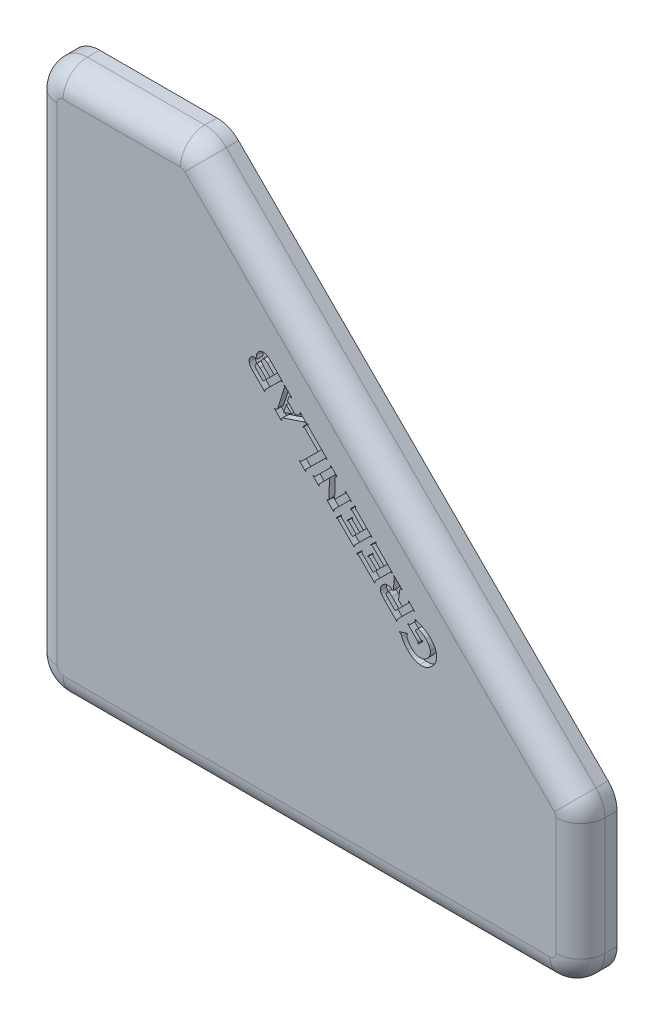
from build123d import *

# Parameters (mm, degrees)
BOSS_EXTRUDE1_DEPTH = 3
FILLET1_R           = 2.500013
FILLET2_R           = 2
CUT_EXTRUDE1_DEPTH  = 0.5


with BuildPart() as part:
    # Sketch1 → Boss-Extrude1 (new body)
    with BuildSketch(Plane.XY.offset(3)):
        Polygon((-9.32015067, 22.500001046), (-22.500150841, 22.500001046), (-22.500150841, -22.499998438), (22.49984816, -22.499998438), (22.49984816, -9.319997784), align=None)
    extrude(amount=-BOSS_EXTRUDE1_DEPTH)

    # Fillet1
    fillet1_edges = [part.edges().sort_by_distance(p)[0] for p in [
        (22.49984816, -9.319997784, 1.5),
        (22.49984816, -22.499998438, 1.5),
        (-22.500150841, -22.499998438, 1.5),
        (-22.500150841, 22.500001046, 1.5),
        (-9.32015067, 22.500001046, 1.5),
    ]]
    fillet(fillet1_edges, radius=FILLET1_R)

    # Fillet2
    fillet2_edges = [part.edges().sort_by_distance(p)[0] for p in [
        (22.49984816, -15.177761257, 3),
        (6.589848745, 6.590001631, 3),
        (-15.177913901, 22.500001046, 3),
        (-22.500150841, 1.304e-06, 3),
        (-0.000151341, -22.499998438, 3),
        (-21.767913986, -21.767761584, 3),
        (-21.767913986, 21.767764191, 3),
        (-9.398976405, 22.309698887, 3),
        (21.767611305, -21.767761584, 3),
        (22.309546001, -9.398823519, 3),
    ]]
    fillet(fillet2_edges, radius=FILLET2_R)

    # Sketch2 → Cut-Extrude1 (cut)
    # profile 1 of 8: a face of its own
    with BuildSketch(Plane.XY.offset(3)):
        with BuildLine():
            add(Edge.make_bspline(
                [(-4.052609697, 9.988719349), (-4.061625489, 10.01338589), (-4.078703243, 10.060109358), (-4.097706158, 10.127687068), (-4.110036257, 10.188300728), (-4.112313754, 10.226484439), (-4.113373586, 10.244253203)],
                knots=[0, 0, 0, 0, 1.194118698, 2.26190481, 3.191178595, 4, 4, 4, 4], degree=3))
            add(Edge.make_bspline(
                [(-4.113373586, 10.244253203), (-4.112251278, 10.258581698), (-4.109986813, 10.28749211), (-4.100600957, 10.330299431), (-4.086086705, 10.372462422), (-4.067784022, 10.414142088), (-4.044759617, 10.455238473), (-4.016805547, 10.495261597), (-3.984816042, 10.535245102), (-3.960423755, 10.560211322), (-3.947900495, 10.573029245)],
                knots=[0, 0, 0, 0, 0.914813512, 1.845806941, 2.782131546, 3.751881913, 4.742218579, 5.777635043, 6.859014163, 8, 8, 8, 8], degree=3))
            add(Edge.make_bspline(
                [(-3.947900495, 10.573029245), (-3.930540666, 10.589548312), (-3.896655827, 10.621792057), (-3.840894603, 10.661961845), (-3.783413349, 10.694431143), (-3.723930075, 10.719180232), (-3.662236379, 10.735580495), (-3.59877923, 10.743481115), (-3.533494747, 10.744490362), (-3.489956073, 10.738368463), (-3.467757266, 10.735247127)],
                knots=[0, 0, 0, 0, 1.087950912, 2.12358309, 3.113398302, 4.082526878, 5.043361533, 6.004617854, 6.982626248, 8, 8, 8, 8], degree=3))
            add(Edge.make_bspline(
                [(-3.467757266, 10.735247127), (-3.44756126, 10.731382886), (-3.406557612, 10.723537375), (-3.346351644, 10.702602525), (-3.285673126, 10.676524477), (-3.224907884, 10.643791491), (-3.164011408, 10.604547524), (-3.103409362, 10.558680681), (-3.042071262, 10.506996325), (-3.002917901, 10.468590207), (-2.982731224, 10.448788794)],
                knots=[0, 0, 0, 0, 0.861251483, 1.748585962, 2.665721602, 3.629309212, 4.639063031, 5.700792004, 6.814575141, 8, 8, 8, 8], degree=3))
            Line((-2.982731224, 10.448788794), (-1.972531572, 9.431536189))
            Line((-1.972531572, 9.431536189), (-2.007253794, 9.396813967))
            add(Edge.make_bspline(
                [(-2.007253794, 9.396813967), (-2.0152966, 9.400824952), (-2.030305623, 9.408310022), (-2.053099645, 9.415797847), (-2.074463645, 9.418577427), (-2.094685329, 9.417491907), (-2.114490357, 9.412658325), (-2.133541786, 9.401945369), (-2.153836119, 9.388741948), (-2.166214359, 9.376967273), (-2.172726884, 9.3707723)],
                knots=[0, 0, 0, 0, 1.176144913, 2.194853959, 3.126109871, 3.980066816, 4.835992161, 5.768151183, 6.825764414, 8, 8, 8, 8], degree=3))
            Line((-2.172726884, 9.3707723), (-3.368473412, 8.183163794))
            add(Edge.make_bspline(
                [(-3.368473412, 8.183163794), (-3.374524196, 8.176556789), (-3.385896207, 8.164139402), (-3.400771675, 8.145270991), (-3.4098727, 8.125863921), (-3.415980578, 8.106893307), (-3.416745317, 8.086862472), (-3.41397225, 8.065374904), (-3.406433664, 8.042061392), (-3.399708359, 8.026134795), (-3.396142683, 8.017690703)],
                knots=[0, 0, 0, 0, 1.175108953, 2.208532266, 3.130785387, 3.970790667, 4.801718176, 5.733666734, 6.798417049, 8, 8, 8, 8], degree=3))
            Line((-3.396142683, 8.017690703), (-3.430864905, 7.983511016))
            Line((-3.430864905, 7.983511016), (-4.431841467, 8.99154053))
            add(Edge.make_bspline(
                [(-4.431841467, 8.99154053), (-4.452916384, 9.01316801), (-4.493518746, 9.054834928), (-4.547940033, 9.119403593), (-4.595509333, 9.182133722), (-4.635084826, 9.243899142), (-4.66755187, 9.304042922), (-4.692997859, 9.362632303), (-4.710161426, 9.420466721), (-4.716001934, 9.458940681), (-4.718842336, 9.477651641)],
                knots=[0, 0, 0, 0, 1.260823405, 2.429068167, 3.524246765, 4.546689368, 5.489478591, 6.37610682, 7.210255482, 8, 8, 8, 8], degree=3))
            add(Edge.make_bspline(
                [(-4.718842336, 9.477651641), (-4.720319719, 9.496804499), (-4.723245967, 9.534740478), (-4.720737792, 9.59129779), (-4.710505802, 9.645973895), (-4.695058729, 9.699232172), (-4.671658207, 9.750234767), (-4.643060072, 9.800144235), (-4.606618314, 9.847440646), (-4.578940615, 9.877004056), (-4.564762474, 9.892148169)],
                knots=[0, 0, 0, 0, 1.004803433, 1.990209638, 2.951832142, 3.910002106, 4.884393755, 5.881052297, 6.91455071, 8, 8, 8, 8], degree=3))
            add(Edge.make_bspline(
                [(-4.564762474, 9.892148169), (-4.54725323, 9.908360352), (-4.513678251, 9.939448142), (-4.458771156, 9.97681107), (-4.403021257, 10.004275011), (-4.344497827, 10.020314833), (-4.28149052, 10.026966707), (-4.211891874, 10.022612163), (-4.134262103, 10.010706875), (-4.080880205, 9.996332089), (-4.052609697, 9.988719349)],
                knots=[0, 0, 0, 0, 1.033588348, 1.981964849, 2.869401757, 3.716124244, 4.599497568, 5.604424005, 6.731327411, 8, 8, 8, 8], degree=3))
        make_face()
        with BuildLine():
            Line((-3.289263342, 8.951935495), (-3.818777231, 9.485247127))
            add(Edge.make_bspline(
                [(-3.818777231, 9.485247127), (-3.838340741, 9.504413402), (-3.874555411, 9.539892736), (-3.929183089, 9.583752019), (-3.978863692, 9.614742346), (-4.024590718, 9.633178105), (-4.068413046, 9.638207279), (-4.110525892, 9.630015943), (-4.151600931, 9.609632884), (-4.174819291, 9.588282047), (-4.187158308, 9.576935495)],
                knots=[0, 0, 0, 0, 1.512587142, 2.80000083, 3.86244346, 4.738380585, 5.501965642, 6.264307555, 7.077594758, 8, 8, 8, 8], degree=3))
            add(Edge.make_bspline(
                [(-4.187158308, 9.576935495), (-4.19821763, 9.564720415), (-4.219125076, 9.541628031), (-4.240315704, 9.501727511), (-4.248251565, 9.460025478), (-4.244143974, 9.416506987), (-4.225462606, 9.370795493), (-4.194379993, 9.321213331), (-4.15117422, 9.26569728), (-4.115759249, 9.228997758), (-4.096555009, 9.209096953)],
                knots=[0, 0, 0, 0, 0.910934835, 1.722105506, 2.466937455, 3.231723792, 4.110167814, 5.175651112, 6.468459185, 8, 8, 8, 8], degree=3))
            Line((-4.096555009, 9.209096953), (-3.56704112, 8.675785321))
            Line((-3.56704112, 8.675785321), (-3.289263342, 8.951935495))
        make_face(mode=Mode.SUBTRACT)
        with BuildLine():
            Line((-2.664263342, 9.572595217), (-3.198660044, 10.110789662))
            add(Edge.make_bspline(
                [(-3.198660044, 10.110789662), (-3.219355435, 10.130852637), (-3.258092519, 10.168405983), (-3.319509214, 10.213423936), (-3.377734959, 10.245967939), (-3.434019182, 10.265190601), (-3.488380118, 10.26931312), (-3.540169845, 10.259780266), (-3.589422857, 10.236385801), (-3.616804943, 10.211589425), (-3.631060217, 10.198680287)],
                knots=[0, 0, 0, 0, 1.382833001, 2.588350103, 3.645353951, 4.576401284, 5.421008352, 6.233527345, 7.080363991, 8, 8, 8, 8], degree=3))
            add(Edge.make_bspline(
                [(-3.631060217, 10.198680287), (-3.644184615, 10.184447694), (-3.669211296, 10.157307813), (-3.692603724, 10.108130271), (-3.703004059, 10.056593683), (-3.698401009, 10.002108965), (-3.680229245, 9.94551833), (-3.647874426, 9.886906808), (-3.60313547, 9.825385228), (-3.565757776, 9.786444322), (-3.545882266, 9.765737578)],
                knots=[0, 0, 0, 0, 0.924924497, 1.763722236, 2.577660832, 3.422057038, 4.358524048, 5.41115404, 6.623386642, 8, 8, 8, 8], degree=3))
            Line((-3.545882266, 9.765737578), (-3.011485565, 9.227543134))
            Line((-3.011485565, 9.227543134), (-2.664263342, 9.572595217))
        make_face(mode=Mode.SUBTRACT)
    # profile 2 of 8: a face of its own
    with BuildSketch(Plane.XY.offset(3)):
        with BuildLine():
            Line((-1.567470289, 8.259890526), (-0.928364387, 7.616444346))
            Line((-0.928364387, 7.616444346), (-0.67717081, 7.699994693))
            add(Edge.make_bspline(
                [(-0.67717081, 7.699994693), (-0.663509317, 7.705195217), (-0.637972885, 7.714916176), (-0.603916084, 7.73169948), (-0.576095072, 7.748178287), (-0.561289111, 7.760929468), (-0.554557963, 7.766726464)],
                knots=[0, 0, 0, 0, 1.248191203, 2.333152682, 3.24221082, 4, 4, 4, 4], degree=3))
            add(Edge.make_bspline(
                [(-0.554557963, 7.766726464), (-0.549425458, 7.772138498), (-0.539538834, 7.782563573), (-0.529110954, 7.801030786), (-0.522439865, 7.820332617), (-0.519595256, 7.84081363), (-0.521429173, 7.862400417), (-0.527653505, 7.884657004), (-0.537753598, 7.907876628), (-0.546610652, 7.923067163), (-0.551302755, 7.931114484)],
                knots=[0, 0, 0, 0, 0.989809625, 1.906647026, 2.797508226, 3.696466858, 4.638256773, 5.660338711, 6.760543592, 8, 8, 8, 8], degree=3))
            Line((-0.551302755, 7.931114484), (-0.516580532, 7.965836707))
            Line((-0.516580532, 7.965836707), (0.000455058, 7.445003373))
            Line((0.000455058, 7.445003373), (-0.034267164, 7.410281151))
            add(Edge.make_bspline(
                [(-0.034267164, 7.410281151), (-0.043319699, 7.416882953), (-0.060422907, 7.429355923), (-0.087394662, 7.442974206), (-0.112868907, 7.45217856), (-0.138535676, 7.455593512), (-0.166487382, 7.453969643), (-0.199324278, 7.448258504), (-0.238604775, 7.438242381), (-0.266523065, 7.4292588), (-0.281662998, 7.424387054)],
                knots=[0, 0, 0, 0, 1.024670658, 1.935938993, 2.758409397, 3.494049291, 4.28989654, 5.313897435, 6.543341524, 8, 8, 8, 8], degree=3))
            Line((-0.281662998, 7.424387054), (-1.892448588, 6.88510754))
            add(Edge.make_bspline(
                [(-1.892448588, 6.88510754), (-1.906873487, 6.880005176), (-1.934276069, 6.870312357), (-1.971285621, 6.85147035), (-2.00331798, 6.831959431), (-2.020868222, 6.816106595), (-2.029167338, 6.808610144)],
                knots=[0, 0, 0, 0, 1.161394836, 2.206269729, 3.151785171, 4, 4, 4, 4], degree=3))
            add(Edge.make_bspline(
                [(-2.029167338, 6.808610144), (-2.036897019, 6.799112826), (-2.052479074, 6.779967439), (-2.060582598, 6.741053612), (-2.056598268, 6.697493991), (-2.045859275, 6.668260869), (-2.040018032, 6.652360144)],
                knots=[0, 0, 0, 0, 0.873026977, 1.759911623, 2.781552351, 4, 4, 4, 4], degree=3))
            Line((-2.040018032, 6.652360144), (-2.074740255, 6.618180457))
            Line((-2.074740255, 6.618180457), (-2.635178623, 7.182416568))
            Line((-2.635178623, 7.182416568), (-2.6004564, 7.216596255))
            add(Edge.make_bspline(
                [(-2.6004564, 7.216596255), (-2.584943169, 7.21064347), (-2.556003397, 7.19953861), (-2.511827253, 7.19696178), (-2.47154136, 7.207216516), (-2.451298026, 7.224194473), (-2.440951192, 7.232872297)],
                knots=[0, 0, 0, 0, 1.160871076, 2.16559288, 3.062392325, 4, 4, 4, 4], degree=3))
            add(Edge.make_bspline(
                [(-2.440951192, 7.232872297), (-2.433584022, 7.240959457), (-2.417941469, 7.258130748), (-2.399743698, 7.290564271), (-2.381297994, 7.32793177), (-2.372057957, 7.355880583), (-2.36716647, 7.370676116)],
                knots=[0, 0, 0, 0, 0.830196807, 1.762738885, 2.815639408, 4, 4, 4, 4], degree=3))
            Line((-2.36716647, 7.370676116), (-1.85935397, 8.956505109))
            add(Edge.make_bspline(
                [(-1.85935397, 8.956505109), (-1.853386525, 8.976347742), (-1.842428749, 9.012783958), (-1.830026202, 9.062955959), (-1.821760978, 9.103229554), (-1.818787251, 9.135746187), (-1.821874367, 9.164187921), (-1.829738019, 9.19218602), (-1.842880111, 9.221624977), (-1.855099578, 9.240588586), (-1.861524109, 9.250558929)],
                knots=[0, 0, 0, 0, 1.614743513, 2.965087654, 4.026632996, 4.817973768, 5.498202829, 6.243649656, 7.076577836, 8, 8, 8, 8], degree=3))
            Line((-1.861524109, 9.250558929), (-1.826801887, 9.285281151))
            Line((-1.826801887, 9.285281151), (-1.223503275, 8.677642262))
            Line((-1.223503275, 8.677642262), (-1.258225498, 8.64292004))
            add(Edge.make_bspline(
                [(-1.258225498, 8.64292004), (-1.266054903, 8.64803172), (-1.280875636, 8.657707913), (-1.303990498, 8.668007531), (-1.325963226, 8.675020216), (-1.347385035, 8.677294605), (-1.368105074, 8.675084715), (-1.38790487, 8.668442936), (-1.406603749, 8.657344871), (-1.417530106, 8.647464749), (-1.423156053, 8.642377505)],
                knots=[0, 0, 0, 0, 1.232196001, 2.332494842, 3.329286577, 4.265054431, 5.153347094, 6.059105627, 7.000639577, 8, 8, 8, 8], degree=3))
            add(Edge.make_bspline(
                [(-1.423156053, 8.642377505), (-1.43032633, 8.634459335), (-1.445743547, 8.617434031), (-1.463838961, 8.585235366), (-1.482290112, 8.547623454), (-1.491846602, 8.519542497), (-1.496940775, 8.504573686)],
                knots=[0, 0, 0, 0, 0.811155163, 1.744110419, 2.797477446, 4, 4, 4, 4], degree=3))
            Line((-1.496940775, 8.504573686), (-1.567470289, 8.259890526))
        make_face()
        Polygon((-1.670551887, 7.947390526), (-1.894618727, 7.2860407), (-1.238694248, 7.512277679), align=None, mode=Mode.SUBTRACT)
    # profile 3 of 8: a face of its own
    with BuildSketch(Plane.XY.offset(3)):
        with BuildLine():
            Line((0.961669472, 5.922116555), (-0.116889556, 7.008271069))
            add(Edge.make_bspline(
                [(-0.116889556, 7.008271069), (-0.123229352, 7.014441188), (-0.13525892, 7.026148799), (-0.154822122, 7.039578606), (-0.173631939, 7.049419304), (-0.192544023, 7.054649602), (-0.212271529, 7.054712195), (-0.233530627, 7.052375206), (-0.256363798, 7.043933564), (-0.271926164, 7.036941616), (-0.280192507, 7.033227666)],
                knots=[0, 0, 0, 0, 1.17108417, 2.222095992, 3.133640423, 3.977031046, 4.792693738, 5.73555689, 6.797183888, 8, 8, 8, 8], degree=3))
            Line((-0.280192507, 7.033227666), (-0.314372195, 7.067949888))
            Line((-0.314372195, 7.067949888), (0.102294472, 7.481903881))
            Line((0.102294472, 7.481903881), (0.13647416, 7.447181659))
            add(Edge.make_bspline(
                [(0.13647416, 7.447181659), (0.132735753, 7.438919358), (0.125697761, 7.423364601), (0.117610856, 7.400626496), (0.1142739, 7.379508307), (0.114413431, 7.359841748), (0.119983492, 7.341180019), (0.128720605, 7.322253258), (0.142721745, 7.303481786), (0.15389872, 7.291364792), (0.159803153, 7.284963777)],
                knots=[0, 0, 0, 0, 1.212772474, 2.283187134, 3.213341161, 4.059923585, 4.886945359, 5.795479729, 6.835423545, 8, 8, 8, 8], degree=3))
            Line((0.159803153, 7.284963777), (1.68758093, 5.746335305))
            Line((1.68758093, 5.746335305), (1.652858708, 5.711613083))
            add(Edge.make_bspline(
                [(1.652858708, 5.711613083), (1.644637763, 5.71565273), (1.629269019, 5.723204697), (1.606030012, 5.730313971), (1.58480254, 5.7340751), (1.564850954, 5.732830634), (1.545758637, 5.727875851), (1.526932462, 5.717954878), (1.507332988, 5.704397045), (1.495010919, 5.69280777), (1.488470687, 5.686656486)],
                knots=[0, 0, 0, 0, 1.205261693, 2.253190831, 3.19369407, 4.029281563, 4.867584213, 5.773629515, 6.818300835, 8, 8, 8, 8], degree=3))
            Line((1.488470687, 5.686656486), (-0.021945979, 4.186547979))
            add(Edge.make_bspline(
                [(-0.021945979, 4.186547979), (-0.027994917, 4.179940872), (-0.039363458, 4.167523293), (-0.054261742, 4.148656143), (-0.063289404, 4.12924502), (-0.069638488, 4.110295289), (-0.069490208, 4.090403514), (-0.06686539, 4.069149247), (-0.05953503, 4.046013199), (-0.052330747, 4.030397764), (-0.048530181, 4.022159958)],
                knots=[0, 0, 0, 0, 1.180600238, 2.218852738, 3.145415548, 3.989346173, 4.823137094, 5.735826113, 6.805552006, 8, 8, 8, 8], degree=3))
            Line((-0.048530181, 4.022159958), (-0.083252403, 3.98798027))
            Line((-0.083252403, 3.98798027), (-0.600287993, 4.508813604))
            Line((-0.600287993, 4.508813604), (-0.565565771, 4.542993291))
            add(Edge.make_bspline(
                [(-0.565565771, 4.542993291), (-0.557533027, 4.538940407), (-0.54238842, 4.531299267), (-0.519436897, 4.524357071), (-0.498258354, 4.52054949), (-0.478173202, 4.521556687), (-0.458727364, 4.527586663), (-0.439421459, 4.537458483), (-0.419500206, 4.551308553), (-0.40717638, 4.562888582), (-0.400635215, 4.569034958)],
                knots=[0, 0, 0, 0, 1.177978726, 2.220912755, 3.133494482, 3.988782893, 4.829472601, 5.784241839, 6.823933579, 8, 8, 8, 8], degree=3))
            Line((-0.400635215, 4.569034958), (0.961669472, 5.922116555))
        make_face()
    # profile 4 of 8: a face of its own
    with BuildSketch(Plane.XY.offset(3)):
        with BuildLine():
            Line((2.304505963, 3.202598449), (3.133499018, 4.026166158))
            add(Edge.make_bspline(
                [(3.133499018, 4.026166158), (3.145164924, 4.038484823), (3.166350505, 4.060855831), (3.180102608, 4.096439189), (3.18257391, 4.124055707), (3.1794463, 4.145701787), (3.172814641, 4.168862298), (3.165902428, 4.184124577), (3.162253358, 4.192181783)],
                knots=[0, 0, 0, 0, 1.65236534, 3.00073726, 3.641986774, 4.357550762, 5.132924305, 6, 6, 6, 6], degree=3))
            Line((3.162253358, 4.192181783), (3.196975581, 4.226904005))
            Line((3.196975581, 4.226904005), (3.679831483, 3.740792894))
            Line((3.679831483, 3.740792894), (3.645109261, 3.706070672))
            add(Edge.make_bspline(
                [(3.645109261, 3.706070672), (3.637066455, 3.710081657), (3.622057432, 3.717566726), (3.59926341, 3.725054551), (3.57789941, 3.727834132), (3.557677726, 3.726748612), (3.537872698, 3.721915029), (3.518821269, 3.711202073), (3.498526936, 3.697998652), (3.486148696, 3.686223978), (3.479636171, 3.680029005)],
                knots=[0, 0, 0, 0, 1.176144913, 2.194853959, 3.126109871, 3.980066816, 4.835992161, 5.768151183, 6.825764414, 8, 8, 8, 8], degree=3))
            Line((3.479636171, 3.680029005), (2.283889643, 2.492420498))
            add(Edge.make_bspline(
                [(2.283889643, 2.492420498), (2.277838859, 2.485813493), (2.266466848, 2.473396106), (2.25159138, 2.454527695), (2.242490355, 2.435120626), (2.236382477, 2.416150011), (2.235617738, 2.396119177), (2.238390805, 2.374631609), (2.245929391, 2.351318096), (2.252654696, 2.3353915), (2.256220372, 2.326947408)],
                knots=[0, 0, 0, 0, 1.175108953, 2.208532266, 3.130785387, 3.970790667, 4.801718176, 5.733666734, 6.798417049, 8, 8, 8, 8], degree=3))
            Line((2.256220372, 2.326947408), (2.22149815, 2.29276772))
            Line((2.22149815, 2.29276772), (1.658347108, 2.859716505))
            Line((1.658347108, 2.859716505), (1.693069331, 2.893896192))
            add(Edge.make_bspline(
                [(1.693069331, 2.893896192), (1.704031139, 2.887688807), (1.723895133, 2.876440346), (1.754298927, 2.869189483), (1.781827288, 2.871628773), (1.795015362, 2.881788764), (1.801576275, 2.886843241)],
                knots=[0, 0, 0, 0, 1.283938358, 2.326636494, 3.167521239, 4, 4, 4, 4], degree=3))
            add(Edge.make_bspline(
                [(1.801576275, 2.886843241), (1.806406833, 2.892982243), (1.816930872, 2.90635691), (1.826955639, 2.932719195), (1.831699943, 2.965329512), (1.83257053, 2.989004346), (1.833043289, 3.001860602)],
                knots=[0, 0, 0, 0, 0.765805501, 1.668413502, 2.733867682, 4, 4, 4, 4], degree=3))
            Line((1.833043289, 3.001860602), (1.882413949, 4.507936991))
            Line((1.882413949, 4.507936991), (1.076749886, 3.707698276))
            add(Edge.make_bspline(
                [(1.076749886, 3.707698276), (1.070424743, 3.701162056), (1.05868551, 3.689031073), (1.044489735, 3.669371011), (1.034776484, 3.650136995), (1.028776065, 3.630881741), (1.027719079, 3.610796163), (1.031651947, 3.589530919), (1.037814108, 3.565966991), (1.045182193, 3.550440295), (1.049080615, 3.542225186)],
                knots=[0, 0, 0, 0, 1.188388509, 2.205605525, 3.157492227, 3.995643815, 4.824737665, 5.757931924, 6.813731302, 8, 8, 8, 8], degree=3))
            Line((1.049080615, 3.542225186), (1.014358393, 3.508045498))
            Line((1.014358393, 3.508045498), (0.532045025, 3.994156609))
            Line((0.532045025, 3.994156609), (0.566767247, 4.028336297))
            add(Edge.make_bspline(
                [(0.566767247, 4.028336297), (0.575007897, 4.024524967), (0.590471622, 4.017372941), (0.613590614, 4.010137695), (0.634810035, 4.006476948), (0.654875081, 4.007481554), (0.674148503, 4.013476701), (0.693453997, 4.02334264), (0.713375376, 4.037194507), (0.725699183, 4.048774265), (0.732240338, 4.054920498)],
                knots=[0, 0, 0, 0, 1.188132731, 2.229551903, 3.164212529, 3.994609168, 4.834077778, 5.787460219, 6.82564181, 8, 8, 8, 8], degree=3))
            Line((0.732240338, 4.054920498), (1.926901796, 5.241443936))
            add(Edge.make_bspline(
                [(1.926901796, 5.241443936), (1.933008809, 5.247824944), (1.944668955, 5.260008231), (1.959038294, 5.279281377), (1.968315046, 5.298725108), (1.974490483, 5.31789613), (1.975034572, 5.338076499), (1.973026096, 5.359727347), (1.966056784, 5.383185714), (1.959266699, 5.399032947), (1.955656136, 5.407459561)],
                knots=[0, 0, 0, 0, 1.155235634, 2.205696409, 3.12612335, 3.964465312, 4.817365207, 5.74475715, 6.800796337, 8, 8, 8, 8], degree=3))
            Line((1.955656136, 5.407459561), (1.990378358, 5.442181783))
            Line((1.990378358, 5.442181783), (2.5144669, 4.914295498))
            Line((2.5144669, 4.914295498), (2.479744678, 4.879573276))
            add(Edge.make_bspline(
                [(2.479744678, 4.879573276), (2.469154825, 4.886227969), (2.450254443, 4.898105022), (2.420991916, 4.907737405), (2.393741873, 4.905789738), (2.380852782, 4.895500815), (2.374492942, 4.89042397)],
                knots=[0, 0, 0, 0, 1.298366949, 2.317277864, 3.169697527, 4, 4, 4, 4], degree=3))
            add(Edge.make_bspline(
                [(2.374492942, 4.89042397), (2.369035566, 4.883104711), (2.357162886, 4.867181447), (2.352042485, 4.839825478), (2.350328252, 4.811267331), (2.349463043, 4.77919369), (2.348203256, 4.737441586), (2.348013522, 4.706326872), (2.34790874, 4.689143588)],
                knots=[0, 0, 0, 0, 0.786713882, 1.711519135, 2.359256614, 3.289415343, 4.503063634, 6, 6, 6, 6], degree=3))
            Line((2.34790874, 4.689143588), (2.304505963, 3.202598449))
        make_face()
    # profile 5 of 8: a face of its own
    with BuildSketch(Plane.XY.offset(3)):
        with BuildLine():
            Line((4.363967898, 1.871689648), (4.676467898, 2.182019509))
            Line((4.676467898, 2.182019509), (3.770977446, 3.094020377))
            add(Edge.make_bspline(
                [(3.770977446, 3.094020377), (3.764610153, 3.100149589), (3.752635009, 3.111676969), (3.733424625, 3.125650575), (3.714489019, 3.134967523), (3.69552841, 3.140331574), (3.675772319, 3.141241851), (3.65444519, 3.138454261), (3.631138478, 3.130938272), (3.615543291, 3.12352038), (3.60713196, 3.119519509)],
                knots=[0, 0, 0, 0, 1.166996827, 2.194803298, 3.124600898, 3.941970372, 4.779695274, 5.719267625, 6.769877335, 8, 8, 8, 8], degree=3))
            Line((3.60713196, 3.119519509), (3.572409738, 3.154241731))
            Line((3.572409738, 3.154241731), (3.989076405, 3.568195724))
            Line((3.989076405, 3.568195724), (4.023798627, 3.533473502))
            add(Edge.make_bspline(
                [(4.023798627, 3.533473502), (4.019756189, 3.525622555), (4.012147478, 3.510845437), (4.005039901, 3.488271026), (4.00152753, 3.467253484), (4.001897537, 3.439965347), (4.016968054, 3.405103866), (4.037121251, 3.382571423), (4.04821269, 3.37017055)],
                knots=[0, 0, 0, 0, 0.878172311, 1.652903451, 2.345844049, 2.994530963, 4.345921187, 6, 6, 6, 6], degree=3))
            Line((4.04821269, 3.37017055), (5.368199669, 2.040960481))
            Line((5.368199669, 2.040960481), (5.333477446, 2.006238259))
            add(Edge.make_bspline(
                [(5.333477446, 2.006238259), (5.32543464, 2.010249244), (5.310425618, 2.017734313), (5.287631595, 2.025222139), (5.266267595, 2.028001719), (5.246045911, 2.026916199), (5.226240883, 2.022082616), (5.207189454, 2.01136966), (5.186895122, 1.998166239), (5.174516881, 1.986391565), (5.168004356, 1.980196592)],
                knots=[0, 0, 0, 0, 1.176144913, 2.194853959, 3.126109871, 3.980066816, 4.835992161, 5.768151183, 6.825764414, 8, 8, 8, 8], degree=3))
            Line((5.168004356, 1.980196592), (3.972257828, 0.792588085))
            add(Edge.make_bspline(
                [(3.972257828, 0.792588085), (3.966207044, 0.78598108), (3.954835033, 0.773563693), (3.939959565, 0.754695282), (3.93085854, 0.735288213), (3.924750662, 0.716317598), (3.923985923, 0.696286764), (3.92675899, 0.674799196), (3.934297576, 0.651485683), (3.941022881, 0.635559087), (3.944588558, 0.627114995)],
                knots=[0, 0, 0, 0, 1.175108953, 2.208532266, 3.130785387, 3.970790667, 4.801718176, 5.733666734, 6.798417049, 8, 8, 8, 8], degree=3))
            Line((3.944588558, 0.627114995), (3.909866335, 0.592935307))
            Line((3.909866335, 0.592935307), (2.625686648, 1.88579555))
            add(Edge.make_bspline(
                [(2.625686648, 1.88579555), (2.619134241, 1.892098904), (2.606791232, 1.903972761), (2.587288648, 1.918404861), (2.567963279, 1.927947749), (2.548771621, 1.933116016), (2.529036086, 1.934140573), (2.507893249, 1.931246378), (2.485013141, 1.923828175), (2.469542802, 1.916713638), (2.461298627, 1.912922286)],
                knots=[0, 0, 0, 0, 1.195531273, 2.252065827, 3.17781469, 4.014602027, 4.848679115, 5.760566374, 6.806601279, 8, 8, 8, 8], degree=3))
            Line((2.461298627, 1.912922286), (2.426576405, 1.947644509))
            Line((2.426576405, 1.947644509), (2.843243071, 2.361055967))
            Line((2.843243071, 2.361055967), (2.877965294, 2.326333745))
            add(Edge.make_bspline(
                [(2.877965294, 2.326333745), (2.873976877, 2.318097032), (2.866421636, 2.302494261), (2.85865227, 2.279215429), (2.855023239, 2.257736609), (2.856066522, 2.237708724), (2.861748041, 2.218624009), (2.872407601, 2.199948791), (2.885490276, 2.179581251), (2.897596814, 2.167341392), (2.90400696, 2.160860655)],
                knots=[0, 0, 0, 0, 1.192898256, 2.259702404, 3.190558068, 4.0175742, 4.853625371, 5.761171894, 6.814589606, 8, 8, 8, 8], degree=3))
            Line((2.90400696, 2.160860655), (3.77369012, 1.285209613))
            Line((3.77369012, 1.285209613), (4.08619012, 1.595539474))
            Line((4.08619012, 1.595539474), (3.53009203, 2.155435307))
            add(Edge.make_bspline(
                [(3.53009203, 2.155435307), (3.523543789, 2.16174578), (3.511208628, 2.173633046), (3.491458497, 2.188120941), (3.471850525, 2.198106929), (3.452135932, 2.203827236), (3.431865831, 2.205440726), (3.410003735, 2.203066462), (3.38643745, 2.196264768), (3.370347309, 2.189768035), (3.361906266, 2.186359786)],
                knots=[0, 0, 0, 0, 1.173462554, 2.210494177, 3.150425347, 4.000479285, 4.844093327, 5.759629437, 6.824679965, 8, 8, 8, 8], degree=3))
            Line((3.361906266, 2.186359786), (3.327184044, 2.221082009))
            Line((3.327184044, 2.221082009), (3.74385071, 2.635036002))
            Line((3.74385071, 2.635036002), (3.778572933, 2.60031378))
            add(Edge.make_bspline(
                [(3.778572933, 2.60031378), (3.774786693, 2.592069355), (3.767681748, 2.576598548), (3.760089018, 2.553378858), (3.757420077, 2.531667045), (3.758262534, 2.511162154), (3.764038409, 2.491299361), (3.774897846, 2.47192237), (3.78917338, 2.451305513), (3.80133938, 2.438473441), (3.807869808, 2.431585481)],
                knots=[0, 0, 0, 0, 1.162372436, 2.181212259, 3.115362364, 3.950891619, 4.794416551, 5.737719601, 6.785660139, 8, 8, 8, 8], degree=3))
            Line((3.807869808, 2.431585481), (4.363967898, 1.871689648))
        make_face()
    # profile 6 of 8: a face of its own
    with BuildSketch(Plane.XY.offset(3)):
        with BuildLine():
            Line((6.052336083, 0.171857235), (6.364836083, 0.482187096))
            Line((6.364836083, 0.482187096), (5.459345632, 1.394187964))
            add(Edge.make_bspline(
                [(5.459345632, 1.394187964), (5.452978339, 1.400317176), (5.441003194, 1.411844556), (5.42179281, 1.425818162), (5.402857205, 1.43513511), (5.383896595, 1.440499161), (5.364140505, 1.441409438), (5.342813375, 1.438621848), (5.319506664, 1.431105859), (5.303911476, 1.423687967), (5.295500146, 1.419687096)],
                knots=[0, 0, 0, 0, 1.166996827, 2.194803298, 3.124600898, 3.941970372, 4.779695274, 5.719267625, 6.769877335, 8, 8, 8, 8], degree=3))
            Line((5.295500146, 1.419687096), (5.260777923, 1.454409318))
            Line((5.260777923, 1.454409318), (5.67744459, 1.868363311))
            Line((5.67744459, 1.868363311), (5.712166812, 1.833641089))
            add(Edge.make_bspline(
                [(5.712166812, 1.833641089), (5.708124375, 1.825790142), (5.700515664, 1.811013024), (5.693408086, 1.788438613), (5.689895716, 1.767421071), (5.690265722, 1.740132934), (5.705336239, 1.705271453), (5.725489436, 1.68273901), (5.736580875, 1.670338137)],
                knots=[0, 0, 0, 0, 0.878172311, 1.652903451, 2.345844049, 2.994530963, 4.345921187, 6, 6, 6, 6], degree=3))
            Line((5.736580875, 1.670338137), (7.056567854, 0.341128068))
            Line((7.056567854, 0.341128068), (7.021845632, 0.306405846))
            add(Edge.make_bspline(
                [(7.021845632, 0.306405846), (7.013802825, 0.310416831), (6.998793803, 0.3179019), (6.975999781, 0.325389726), (6.95463578, 0.328169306), (6.934414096, 0.327083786), (6.914609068, 0.322250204), (6.895557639, 0.311537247), (6.875263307, 0.298333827), (6.862885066, 0.286559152), (6.856372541, 0.280364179)],
                knots=[0, 0, 0, 0, 1.176144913, 2.194853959, 3.126109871, 3.980066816, 4.835992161, 5.768151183, 6.825764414, 8, 8, 8, 8], degree=3))
            Line((6.856372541, 0.280364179), (5.660626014, -0.907244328))
            add(Edge.make_bspline(
                [(5.660626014, -0.907244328), (5.65457523, -0.913851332), (5.643203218, -0.92626872), (5.62832775, -0.945137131), (5.619226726, -0.9645442), (5.613118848, -0.983514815), (5.612354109, -1.003545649), (5.615127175, -1.025033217), (5.622665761, -1.04834673), (5.629391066, -1.064273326), (5.632956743, -1.072717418)],
                knots=[0, 0, 0, 0, 1.175108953, 2.208532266, 3.130785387, 3.970790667, 4.801718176, 5.733666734, 6.798417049, 8, 8, 8, 8], degree=3))
            Line((5.632956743, -1.072717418), (5.598234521, -1.106897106))
            Line((5.598234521, -1.106897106), (4.314054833, 0.185963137))
            add(Edge.make_bspline(
                [(4.314054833, 0.185963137), (4.307502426, 0.192266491), (4.295159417, 0.204140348), (4.275656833, 0.218572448), (4.256331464, 0.228115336), (4.237139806, 0.233283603), (4.217404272, 0.234308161), (4.196261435, 0.231413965), (4.173381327, 0.223995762), (4.157910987, 0.216881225), (4.149666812, 0.213089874)],
                knots=[0, 0, 0, 0, 1.195531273, 2.252065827, 3.17781469, 4.014602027, 4.848679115, 5.760566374, 6.806601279, 8, 8, 8, 8], degree=3))
            Line((4.149666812, 0.213089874), (4.11494459, 0.247812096))
            Line((4.11494459, 0.247812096), (4.531611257, 0.661223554))
            Line((4.531611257, 0.661223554), (4.566333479, 0.626501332))
            add(Edge.make_bspline(
                [(4.566333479, 0.626501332), (4.562345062, 0.618264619), (4.554789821, 0.602661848), (4.547020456, 0.579383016), (4.543391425, 0.557904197), (4.544434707, 0.537876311), (4.550116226, 0.518791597), (4.560775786, 0.500116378), (4.573858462, 0.479748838), (4.585964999, 0.467508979), (4.592375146, 0.461028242)],
                knots=[0, 0, 0, 0, 1.192898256, 2.259702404, 3.190558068, 4.0175742, 4.853625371, 5.761171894, 6.814589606, 8, 8, 8, 8], degree=3))
            Line((4.592375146, 0.461028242), (5.462058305, -0.4146228))
            Line((5.462058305, -0.4146228), (5.774558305, -0.104292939))
            Line((5.774558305, -0.104292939), (5.218460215, 0.455602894))
            add(Edge.make_bspline(
                [(5.218460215, 0.455602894), (5.211911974, 0.461913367), (5.199576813, 0.473800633), (5.179826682, 0.488288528), (5.16021871, 0.498274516), (5.140504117, 0.503994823), (5.120234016, 0.505608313), (5.09837192, 0.503234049), (5.074805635, 0.496432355), (5.058715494, 0.489935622), (5.050274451, 0.486527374)],
                knots=[0, 0, 0, 0, 1.173462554, 2.210494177, 3.150425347, 4.000479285, 4.844093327, 5.759629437, 6.824679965, 8, 8, 8, 8], degree=3))
            Line((5.050274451, 0.486527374), (5.015552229, 0.521249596))
            Line((5.015552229, 0.521249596), (5.432218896, 0.935203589))
            Line((5.432218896, 0.935203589), (5.466941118, 0.900481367))
            add(Edge.make_bspline(
                [(5.466941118, 0.900481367), (5.463154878, 0.892236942), (5.456049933, 0.876766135), (5.448457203, 0.853546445), (5.445788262, 0.831834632), (5.446630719, 0.811329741), (5.452406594, 0.791466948), (5.463266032, 0.772089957), (5.477541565, 0.7514731), (5.489707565, 0.738641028), (5.496237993, 0.731753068)],
                knots=[0, 0, 0, 0, 1.162372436, 2.181212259, 3.115362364, 3.950891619, 4.794416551, 5.737719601, 6.785660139, 8, 8, 8, 8], degree=3))
            Line((5.496237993, 0.731753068), (6.052336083, 0.171857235))
        make_face()
    # profile 7 of 8: a face of its own
    with BuildSketch(Plane.XY.offset(3)):
        with BuildLine():
            Line((7.863049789, -1.65115144), (8.322576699, -1.194879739))
            add(Edge.make_bspline(
                [(8.322576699, -1.194879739), (8.328715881, -1.188516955), (8.34026201, -1.176550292), (8.354016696, -1.157416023), (8.363767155, -1.138668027), (8.368799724, -1.119581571), (8.369826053, -1.099499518), (8.366970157, -1.078051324), (8.360056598, -1.054613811), (8.353321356, -1.038921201), (8.349703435, -1.030491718)],
                knots=[0, 0, 0, 0, 1.167022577, 2.194851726, 3.103234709, 3.943700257, 4.781443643, 5.74474406, 6.788560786, 8, 8, 8, 8], degree=3))
            Line((8.349703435, -1.030491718), (8.384425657, -0.995769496))
            Line((8.384425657, -0.995769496), (8.86728156, -1.481880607))
            Line((8.86728156, -1.481880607), (8.832559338, -1.516602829))
            add(Edge.make_bspline(
                [(8.832559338, -1.516602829), (8.824516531, -1.512591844), (8.809507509, -1.505106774), (8.786713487, -1.497618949), (8.765349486, -1.494839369), (8.745127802, -1.495924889), (8.725322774, -1.500758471), (8.706271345, -1.511471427), (8.685977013, -1.524674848), (8.673598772, -1.536449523), (8.667086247, -1.542644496)],
                knots=[0, 0, 0, 0, 1.176144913, 2.194853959, 3.126109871, 3.980066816, 4.835992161, 5.768151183, 6.825764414, 8, 8, 8, 8], degree=3))
            Line((8.667086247, -1.542644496), (7.47133972, -2.730253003))
            add(Edge.make_bspline(
                [(7.47133972, -2.730253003), (7.465288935, -2.736860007), (7.453916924, -2.749277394), (7.439041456, -2.768145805), (7.429940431, -2.787552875), (7.423832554, -2.806523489), (7.423067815, -2.826554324), (7.425840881, -2.848041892), (7.433379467, -2.871355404), (7.440104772, -2.887282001), (7.443670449, -2.895726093)],
                knots=[0, 0, 0, 0, 1.175108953, 2.208532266, 3.130785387, 3.970790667, 4.801718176, 5.733666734, 6.798417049, 8, 8, 8, 8], degree=3))
            Line((7.443670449, -2.895726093), (7.408948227, -2.92990578))
            Line((7.408948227, -2.92990578), (6.44432149, -1.958768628))
            add(Edge.make_bspline(
                [(6.44432149, -1.958768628), (6.429268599, -1.943438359), (6.400055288, -1.913686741), (6.358273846, -1.869737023), (6.31975348, -1.827954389), (6.284421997, -1.78855028), (6.252899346, -1.750982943), (6.224837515, -1.715769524), (6.199482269, -1.683133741), (6.170904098, -1.642435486), (6.140468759, -1.592055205), (6.110503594, -1.530517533), (6.086633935, -1.467928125), (6.076224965, -1.425044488), (6.071057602, -1.403755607)],
                knots=[0, 0, 0, 0, 1.139770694, 2.211965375, 3.216802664, 4.154548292, 5.01932526, 5.817922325, 6.543257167, 7.211321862, 8.455195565, 9.660893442, 10.838788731, 12, 12, 12, 12], degree=3))
            add(Edge.make_bspline(
                [(6.071057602, -1.403755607), (6.067497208, -1.381930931), (6.060436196, -1.338647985), (6.061641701, -1.273033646), (6.070502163, -1.208089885), (6.090176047, -1.144434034), (6.117842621, -1.081257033), (6.156210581, -1.01998326), (6.202350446, -0.958623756), (6.238819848, -0.920534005), (6.257689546, -0.900825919)],
                knots=[0, 0, 0, 0, 0.945277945, 1.874686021, 2.798007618, 3.743824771, 4.718131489, 5.743549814, 6.832486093, 8, 8, 8, 8], degree=3))
            add(Edge.make_bspline(
                [(6.257689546, -0.900825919), (6.272870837, -0.886506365), (6.302376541, -0.858675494), (6.348807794, -0.821416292), (6.395893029, -0.789794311), (6.443952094, -0.764145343), (6.492442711, -0.743932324), (6.541622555, -0.728886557), (6.591584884, -0.720420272), (6.642310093, -0.717072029), (6.694357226, -0.719248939), (6.748087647, -0.727688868), (6.80376252, -0.741445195), (6.861366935, -0.760661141), (6.921264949, -0.785132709), (6.982880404, -0.815738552), (7.04675216, -0.851592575), (7.088827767, -0.879051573), (7.110554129, -0.893230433)],
                knots=[0, 0, 0, 0, 1.060858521, 2.061838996, 3.023350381, 3.940756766, 4.827080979, 5.691134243, 6.54983728, 7.397638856, 8.272004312, 9.192768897, 10.158492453, 11.184997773, 12.277894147, 13.445856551, 14.681130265, 16, 16, 16, 16], degree=3))
            Line((7.110554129, -0.893230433), (7.185966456, -0.240018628))
            add(Edge.make_bspline(
                [(7.185966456, -0.240018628), (7.189779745, -0.211288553), (7.196818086, -0.158260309), (7.203772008, -0.084623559), (7.205736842, -0.023526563), (7.20328447, 0.027159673), (7.196301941, 0.070836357), (7.183396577, 0.110801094), (7.166152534, 0.149214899), (7.150840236, 0.172848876), (7.143106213, 0.18478606)],
                knots=[0, 0, 0, 0, 1.586447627, 2.928169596, 4.047224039, 4.929682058, 5.702742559, 6.460437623, 7.222389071, 8, 8, 8, 8], degree=3))
            Line((7.143106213, 0.18478606), (7.177828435, 0.219508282))
            Line((7.177828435, 0.219508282), (7.849486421, -0.457032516))
            Line((7.849486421, -0.457032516), (7.814764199, -0.491754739))
            add(Edge.make_bspline(
                [(7.814764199, -0.491754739), (7.80109926, -0.483914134), (7.776812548, -0.469979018), (7.740667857, -0.458920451), (7.708096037, -0.459320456), (7.692893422, -0.470994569), (7.685640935, -0.476563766)],
                knots=[0, 0, 0, 0, 1.346518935, 2.393169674, 3.233453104, 4, 4, 4, 4], degree=3))
            add(Edge.make_bspline(
                [(7.685640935, -0.476563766), (7.680758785, -0.482690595), (7.669552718, -0.49675359), (7.660093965, -0.526450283), (7.650567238, -0.563998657), (7.646951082, -0.592586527), (7.644950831, -0.608399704)],
                knots=[0, 0, 0, 0, 0.667482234, 1.532081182, 2.634888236, 4, 4, 4, 4], degree=3))
            Line((7.644950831, -0.608399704), (7.552177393, -1.338108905))
            Line((7.552177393, -1.338108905), (7.863049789, -1.65115144))
        make_face()
        with BuildLine():
            Line((7.585272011, -1.927301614), (7.029716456, -1.367948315))
            add(Edge.make_bspline(
                [(7.029716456, -1.367948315), (7.009716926, -1.348313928), (6.972491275, -1.311767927), (6.917034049, -1.26504802), (6.867436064, -1.228304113), (6.833913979, -1.211667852), (6.818670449, -1.204102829)],
                knots=[0, 0, 0, 0, 1.251942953, 2.330274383, 3.240724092, 4, 4, 4, 4], degree=3))
            add(Edge.make_bspline(
                [(6.818670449, -1.204102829), (6.809008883, -1.200156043), (6.790265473, -1.19249929), (6.761060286, -1.186733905), (6.732707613, -1.184754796), (6.704778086, -1.188194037), (6.677712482, -1.196439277), (6.651171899, -1.209202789), (6.625400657, -1.226784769), (6.609780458, -1.241486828), (6.60165656, -1.249133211)],
                knots=[0, 0, 0, 0, 1.051616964, 2.040133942, 2.991341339, 3.910996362, 4.864305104, 5.836321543, 6.874694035, 8, 8, 8, 8], degree=3))
            add(Edge.make_bspline(
                [(6.60165656, -1.249133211), (6.588584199, -1.263202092), (6.564179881, -1.289466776), (6.540736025, -1.335951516), (6.531292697, -1.383594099), (6.536405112, -1.423801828), (6.547334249, -1.456090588), (6.560060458, -1.482454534), (6.576331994, -1.510905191), (6.597447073, -1.540412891), (6.621023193, -1.572784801), (6.64969216, -1.606138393), (6.681451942, -1.642188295), (6.704970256, -1.665920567), (6.717216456, -1.678278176)],
                knots=[0, 0, 0, 0, 1.352733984, 2.525370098, 3.631673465, 4.739085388, 5.345801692, 6.03815571, 6.806024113, 7.661090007, 8.602489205, 9.637509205, 10.7698296, 12, 12, 12, 12], degree=3))
            Line((6.717216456, -1.678278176), (7.272772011, -2.237631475))
            Line((7.272772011, -2.237631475), (7.585272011, -1.927301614))
        make_face(mode=Mode.SUBTRACT)
    # profile 8 of 8: a face of its own
    with BuildSketch(Plane.XY.offset(3)):
        with BuildLine():
            Line((8.931536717, -2.796396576), (9.357969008, -3.225541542))
            add(Edge.make_bspline(
                [(9.357969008, -3.225541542), (9.364394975, -3.231408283), (9.376451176, -3.242415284), (9.394783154, -3.256807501), (9.4135109, -3.265158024), (9.431738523, -3.271158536), (9.451248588, -3.270217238), (9.472227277, -3.26743557), (9.49487814, -3.258943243), (9.510289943, -3.252034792), (9.518559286, -3.248328)],
                knots=[0, 0, 0, 0, 1.174326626, 2.203235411, 3.119376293, 3.929825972, 4.758767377, 5.72079872, 6.777073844, 8, 8, 8, 8], degree=3))
            Line((9.518559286, -3.248328), (9.552738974, -3.283050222))
            Line((9.552738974, -3.283050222), (9.170794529, -3.662281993))
            Line((9.170794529, -3.662281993), (9.136614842, -3.627559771))
            add(Edge.make_bspline(
                [(9.136614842, -3.627559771), (9.140834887, -3.619342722), (9.148718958, -3.603991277), (9.156191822, -3.581083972), (9.160686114, -3.560486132), (9.160069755, -3.541384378), (9.155482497, -3.52306428), (9.146393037, -3.504963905), (9.133148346, -3.486545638), (9.122287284, -3.474807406), (9.116541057, -3.468597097)],
                knots=[0, 0, 0, 0, 1.255281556, 2.345171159, 3.272198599, 4.10957584, 4.921599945, 5.824449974, 6.848988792, 8, 8, 8, 8], degree=3))
            Line((9.116541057, -3.468597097), (8.30924939, -2.655880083))
            Line((8.30924939, -2.655880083), (8.343971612, -2.621157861))
            add(Edge.make_bspline(
                [(8.343971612, -2.621157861), (8.352211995, -2.624966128), (8.367675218, -2.632112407), (8.390626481, -2.63933162), (8.411642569, -2.642874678), (8.431462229, -2.642579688), (8.450650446, -2.637250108), (8.469561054, -2.627779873), (8.489164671, -2.614336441), (8.501286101, -2.602903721), (8.507817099, -2.596743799)],
                knots=[0, 0, 0, 0, 1.202481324, 2.256477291, 3.178738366, 4.018136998, 4.861292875, 5.794087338, 6.811459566, 8, 8, 8, 8], degree=3))
            Line((8.507817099, -2.596743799), (8.873485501, -2.233245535))
            add(Edge.make_bspline(
                [(8.873485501, -2.233245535), (8.879633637, -2.226887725), (8.891196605, -2.214930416), (8.904982, -2.195536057), (8.915084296, -2.176901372), (8.920305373, -2.157779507), (8.921259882, -2.138045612), (8.918458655, -2.116711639), (8.910946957, -2.093407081), (8.903528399, -2.077811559), (8.899527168, -2.069400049)],
                knots=[0, 0, 0, 0, 1.165440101, 2.191875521, 3.13110448, 3.947383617, 4.783991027, 5.722310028, 6.771518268, 8, 8, 8, 8], degree=3))
            Line((8.899527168, -2.069400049), (8.93424939, -2.035220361))
            add(Edge.make_bspline(
                [(8.93424939, -2.035220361), (8.997574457, -2.054842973), (9.122189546, -2.093457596), (9.302596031, -2.161319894), (9.473217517, -2.237304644), (9.634175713, -2.320883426), (9.78571315, -2.412116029), (9.927123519, -2.511667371), (10.060235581, -2.617589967), (10.140903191, -2.695718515), (10.180994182, -2.734547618)],
                knots=[0, 0, 0, 0, 1.101116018, 2.166846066, 3.199663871, 4.20204373, 5.177853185, 6.135467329, 7.073346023, 8, 8, 8, 8], degree=3))
            add(Edge.make_bspline(
                [(10.180994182, -2.734547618), (10.214910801, -2.770119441), (10.281288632, -2.839736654), (10.371063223, -2.949074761), (10.449442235, -3.059838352), (10.51667849, -3.171960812), (10.572460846, -3.2856967), (10.616239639, -3.401127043), (10.650472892, -3.517655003), (10.663387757, -3.596823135), (10.669817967, -3.636240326)],
                knots=[0, 0, 0, 0, 1.129722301, 2.21096673, 3.24919351, 4.246770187, 5.213723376, 6.157331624, 7.082549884, 8, 8, 8, 8], degree=3))
            add(Edge.make_bspline(
                [(10.669817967, -3.636240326), (10.672890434, -3.66080354), (10.678997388, -3.709626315), (10.681734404, -3.782704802), (10.681262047, -3.854571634), (10.67731395, -3.92530618), (10.667604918, -3.994962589), (10.654939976, -4.063720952), (10.637447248, -4.131313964), (10.615520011, -4.197488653), (10.590265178, -4.262987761), (10.559542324, -4.32684089), (10.525319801, -4.389847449), (10.487397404, -4.452113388), (10.444268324, -4.512585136), (10.397586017, -4.572492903), (10.346573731, -4.631238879), (10.309776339, -4.668692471), (10.291128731, -4.687672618)],
                knots=[0, 0, 0, 0, 1.022380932, 2.03212311, 3.018481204, 3.991704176, 4.956543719, 5.922308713, 6.879216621, 7.838572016, 8.801557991, 9.777530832, 10.763888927, 11.763488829, 12.787615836, 13.830944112, 14.900799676, 16, 16, 16, 16], degree=3))
            add(Edge.make_bspline(
                [(10.291128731, -4.687672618), (10.25544011, -4.721354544), (10.18568834, -4.787184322), (10.071871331, -4.871119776), (9.954280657, -4.940105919), (9.832266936, -4.993726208), (9.706327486, -5.032630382), (9.57610517, -5.055924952), (9.441854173, -5.06450279), (9.351619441, -5.058175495), (9.305885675, -5.054968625)],
                knots=[0, 0, 0, 0, 1.080908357, 2.112585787, 3.109419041, 4.080419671, 5.043772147, 6.007874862, 6.990329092, 8, 8, 8, 8], degree=3))
            add(Edge.make_bspline(
                [(9.305885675, -5.054968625), (9.261764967, -5.049233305), (9.173324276, -5.03773676), (9.042764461, -5.002921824), (8.9139098, -4.955541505), (8.786142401, -4.894897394), (8.66037444, -4.820272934), (8.536439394, -4.732052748), (8.412989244, -4.631833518), (8.335431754, -4.556118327), (8.295686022, -4.517316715)],
                knots=[0, 0, 0, 0, 0.913851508, 1.831830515, 2.770454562, 3.733350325, 4.735055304, 5.772763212, 6.858612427, 8, 8, 8, 8], degree=3))
            add(Edge.make_bspline(
                [(8.295686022, -4.517316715), (8.270796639, -4.491725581), (8.221762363, -4.441308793), (8.154283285, -4.362064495), (8.090882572, -4.283201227), (8.032893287, -4.201217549), (7.977880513, -4.113994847), (7.923698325, -4.01862441), (7.869013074, -3.914227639), (7.834097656, -3.840719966), (7.816085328, -3.802798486)],
                knots=[0, 0, 0, 0, 0.989680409, 1.949757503, 2.884913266, 3.794948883, 4.732682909, 5.743484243, 6.835898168, 8, 8, 8, 8], degree=3))
            add(Edge.make_bspline(
                [(7.816085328, -3.802798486), (7.807430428, -3.78406342), (7.791544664, -3.749675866), (7.767092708, -3.70437732), (7.746122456, -3.668469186), (7.730233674, -3.650177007), (7.72331189, -3.642208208)],
                knots=[0, 0, 0, 0, 1.329830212, 2.440856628, 3.320775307, 4, 4, 4, 4], degree=3))
            add(Edge.make_bspline(
                [(7.72331189, -3.642208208), (7.718037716, -3.637821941), (7.706835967, -3.628506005), (7.685290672, -3.618347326), (7.65937506, -3.610298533), (7.640182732, -3.607397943), (7.629995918, -3.605858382)],
                knots=[0, 0, 0, 0, 0.806606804, 1.713141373, 2.786191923, 4, 4, 4, 4], degree=3))
            Line((7.629995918, -3.605858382), (7.614262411, -3.553232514))
            Line((7.614262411, -3.553232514), (8.265304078, -3.354664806))
            Line((8.265304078, -3.354664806), (8.284292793, -3.411088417))
            add(Edge.make_bspline(
                [(8.284292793, -3.411088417), (8.278637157, -3.417548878), (8.26805295, -3.429639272), (8.253985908, -3.447271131), (8.244917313, -3.464111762), (8.238425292, -3.480062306), (8.236855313, -3.497503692), (8.236056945, -3.517998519), (8.238652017, -3.542678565), (8.241519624, -3.560485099), (8.243060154, -3.57005109)],
                knots=[0, 0, 0, 0, 1.18729279, 2.221952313, 3.105534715, 3.825098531, 4.581478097, 5.506500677, 6.660447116, 8, 8, 8, 8], degree=3))
            add(Edge.make_bspline(
                [(8.243060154, -3.57005109), (8.248242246, -3.594099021), (8.259327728, -3.645542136), (8.290422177, -3.724152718), (8.330458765, -3.810560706), (8.381331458, -3.901648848), (8.438768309, -3.992908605), (8.500376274, -4.079785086), (8.564566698, -4.159839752), (8.61091831, -4.208557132), (8.633685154, -4.232485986)],
                knots=[0, 0, 0, 0, 0.757911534, 1.621317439, 2.599941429, 3.696389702, 4.837385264, 5.925867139, 6.981233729, 8, 8, 8, 8], degree=3))
            add(Edge.make_bspline(
                [(8.633685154, -4.232485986), (8.656818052, -4.255150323), (8.702196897, -4.299610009), (8.775462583, -4.357960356), (8.849741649, -4.409668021), (8.926762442, -4.452302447), (9.004830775, -4.488681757), (9.085249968, -4.516251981), (9.167248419, -4.536982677), (9.223136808, -4.543764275), (9.251089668, -4.547156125)],
                knots=[0, 0, 0, 0, 1.098061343, 2.154021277, 3.17343104, 4.165080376, 5.136982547, 6.09165042, 7.045529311, 8, 8, 8, 8], degree=3))
            add(Edge.make_bspline(
                [(9.251089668, -4.547156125), (9.282368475, -4.549129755), (9.343881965, -4.553011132), (9.435253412, -4.546588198), (9.523791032, -4.531067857), (9.609192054, -4.504876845), (9.691353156, -4.468571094), (9.770495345, -4.422590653), (9.846847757, -4.366671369), (9.893534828, -4.322704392), (9.917322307, -4.300302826)],
                knots=[0, 0, 0, 0, 1.022194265, 2.010266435, 2.981886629, 3.951136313, 4.91864033, 5.907963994, 6.934089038, 8, 8, 8, 8], degree=3))
            add(Edge.make_bspline(
                [(9.917322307, -4.300302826), (9.939384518, -4.277258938), (9.98247765, -4.232248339), (10.03690609, -4.15797688), (10.082505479, -4.081322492), (10.117879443, -4.001137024), (10.143720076, -3.917961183), (10.159326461, -3.831637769), (10.165678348, -3.742051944), (10.161805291, -3.681624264), (10.159835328, -3.650888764)],
                knots=[0, 0, 0, 0, 1.065834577, 2.081847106, 3.071325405, 4.043351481, 5.005526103, 5.977006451, 6.971039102, 8, 8, 8, 8], degree=3))
            add(Edge.make_bspline(
                [(10.159835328, -3.650888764), (10.156468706, -3.62239043), (10.149713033, -3.5652039), (10.128306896, -3.480613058), (10.099208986, -3.396937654), (10.060619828, -3.314786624), (10.014488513, -3.233346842), (9.95856727, -3.153871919), (9.895166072, -3.074639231), (9.847377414, -3.024806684), (9.822921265, -2.999304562)],
                knots=[0, 0, 0, 0, 0.919155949, 1.844435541, 2.790605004, 3.755577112, 4.750140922, 5.787502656, 6.867740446, 8, 8, 8, 8], degree=3))
            add(Edge.make_bspline(
                [(9.822921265, -2.999304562), (9.797878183, -2.974774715), (9.747815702, -2.925738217), (9.66792362, -2.85764616), (9.584642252, -2.793860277), (9.498635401, -2.735422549), (9.412129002, -2.682636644), (9.326880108, -2.636664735), (9.243304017, -2.59884427), (9.187219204, -2.579180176), (9.159943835, -2.569617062)],
                knots=[0, 0, 0, 0, 1.055615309, 2.11023232, 3.159391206, 4.213951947, 5.240627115, 6.210533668, 7.129740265, 8, 8, 8, 8], degree=3))
            Line((9.159943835, -2.569617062), (8.931536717, -2.796396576))
        make_face()
    extrude(amount=-CUT_EXTRUDE1_DEPTH, mode=Mode.SUBTRACT)


solid = part.part
